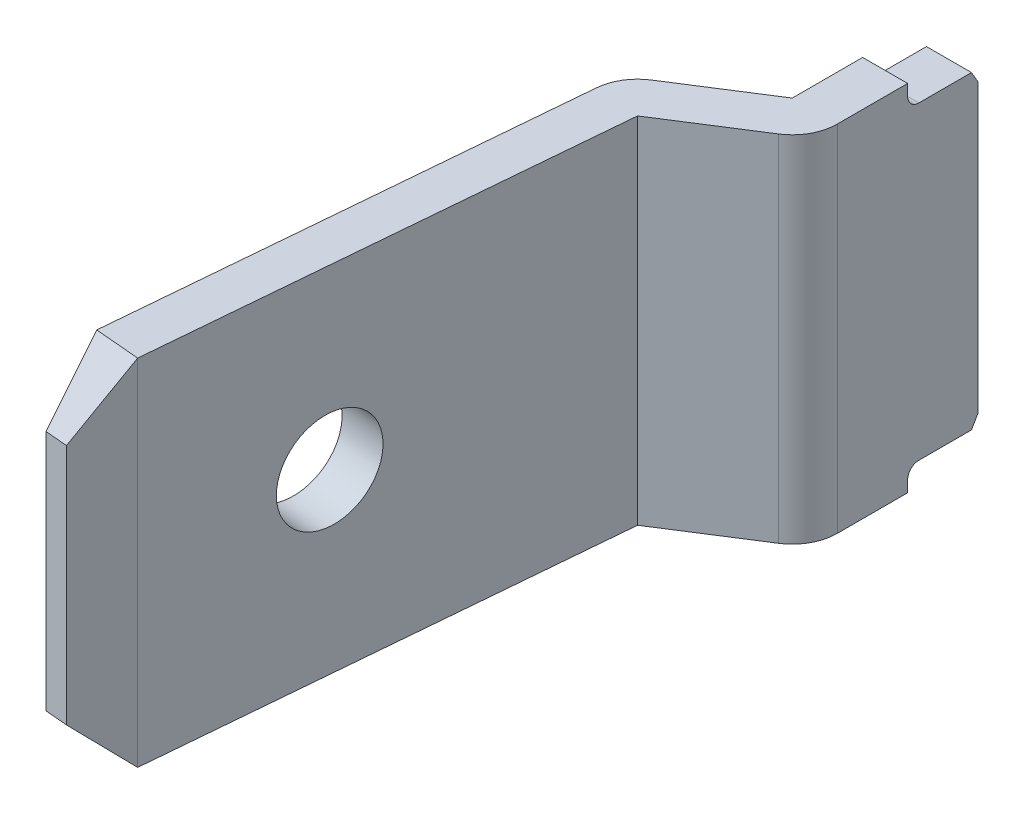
ISO-10303-21;
HEADER;
FILE_DESCRIPTION(('STEP AP214'),'2;1');
FILE_NAME('part.step','',(''),(''),'','','');
FILE_SCHEMA(('AUTOMOTIVE_DESIGN { 1 0 10303 214 1 1 1 1 }'));
ENDSEC;
DATA;
#1=APPLICATION_CONTEXT('core data for automotive mechanical design processes');
#2=APPLICATION_PROTOCOL_DEFINITION('international standard','automotive_design',2000,#1);
#3=PRODUCT_CONTEXT('',#1,'mechanical');
#4=PRODUCT('Part','Part','',(#3));
#5=PRODUCT_RELATED_PRODUCT_CATEGORY('part','',(#4));
#6=PRODUCT_DEFINITION_FORMATION('','',#4);
#7=PRODUCT_DEFINITION_CONTEXT('part definition',#1,'design');
#8=PRODUCT_DEFINITION('design','',#6,#7);
#9=PRODUCT_DEFINITION_SHAPE('','',#8);
#10=(LENGTH_UNIT() NAMED_UNIT(*) SI_UNIT(.MILLI.,.METRE.));
#11=(NAMED_UNIT(*) PLANE_ANGLE_UNIT() SI_UNIT($,.RADIAN.));
#12=(NAMED_UNIT(*) SI_UNIT($,.STERADIAN.) SOLID_ANGLE_UNIT());
#13=UNCERTAINTY_MEASURE_WITH_UNIT(LENGTH_MEASURE(1.E-05),#10,'distance_accuracy_value','');
#14=(GEOMETRIC_REPRESENTATION_CONTEXT(3) GLOBAL_UNCERTAINTY_ASSIGNED_CONTEXT((#13)) GLOBAL_UNIT_ASSIGNED_CONTEXT((#10,
#11,#12)) REPRESENTATION_CONTEXT('',''));
#15=CARTESIAN_POINT('',(0.,0.,0.));
#16=DIRECTION('',(0.,0.,1.));
#17=DIRECTION('',(1.,0.,0.));
#18=AXIS2_PLACEMENT_3D('',#15,#16,#17);
#19=CARTESIAN_POINT('',(-9.8,5.025,2.8));
#20=DIRECTION('',(-1.,0.,0.));
#21=DIRECTION('',(0.,0.,1.));
#22=AXIS2_PLACEMENT_3D('',#19,#20,#21);
#23=PLANE('',#22);
#24=CARTESIAN_POINT('',(-9.8,7.975,3.85));
#25=DIRECTION('',(-1.,0.,0.));
#26=DIRECTION('',(0.,0.,1.));
#27=AXIS2_PLACEMENT_3D('',#24,#25,#26);
#28=CIRCLE('',#27,0.200000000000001);
#29=CARTESIAN_POINT('',(-9.8,7.775,3.85));
#30=VERTEX_POINT('',#29);
#31=CARTESIAN_POINT('',(-9.8,7.975,4.05));
#32=VERTEX_POINT('',#31);
#33=EDGE_CURVE('E230',#30,#32,#28,.T.);
#34=ORIENTED_EDGE('',*,*,#33,.T.);
#35=DIRECTION('',(0.,1.,0.));
#36=VECTOR('',#35,1.);
#37=CARTESIAN_POINT('',(-9.8,5.025,4.05));
#38=LINE('',#37,#36);
#39=CARTESIAN_POINT('',(-9.8,8.175,4.05));
#40=VERTEX_POINT('',#39);
#41=EDGE_CURVE('E175',#40,#32,#38,.F.);
#42=ORIENTED_EDGE('',*,*,#41,.F.);
#43=DIRECTION('',(0.,0.,1.));
#44=VECTOR('',#43,1.);
#45=CARTESIAN_POINT('',(-9.8,8.175,2.8));
#46=LINE('',#45,#44);
#47=CARTESIAN_POINT('',(-9.8,8.175,5.30067147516));
#48=VERTEX_POINT('',#47);
#49=EDGE_CURVE('E148',#48,#40,#46,.F.);
#50=ORIENTED_EDGE('',*,*,#49,.F.);
#51=DIRECTION('',(0.,-1.,0.));
#52=VECTOR('',#51,1.);
#53=CARTESIAN_POINT('',(-9.8,5.025,5.30067147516));
#54=LINE('',#53,#52);
#55=CARTESIAN_POINT('',(-9.8,1.875,5.30067147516));
#56=VERTEX_POINT('',#55);
#57=EDGE_CURVE('E172',#56,#48,#54,.F.);
#58=ORIENTED_EDGE('',*,*,#57,.F.);
#59=DIRECTION('',(0.,0.,1.));
#60=VECTOR('',#59,1.);
#61=CARTESIAN_POINT('',(-9.8,1.875,2.8));
#62=LINE('',#61,#60);
#63=CARTESIAN_POINT('',(-9.8,1.875,4.05));
#64=VERTEX_POINT('',#63);
#65=EDGE_CURVE('E159',#64,#56,#62,.T.);
#66=ORIENTED_EDGE('',*,*,#65,.F.);
#67=DIRECTION('',(0.,1.,0.));
#68=VECTOR('',#67,1.);
#69=CARTESIAN_POINT('',(-9.8,5.025,4.05));
#70=LINE('',#69,#68);
#71=CARTESIAN_POINT('',(-9.8,2.075,4.05));
#72=VERTEX_POINT('',#71);
#73=EDGE_CURVE('E95',#72,#64,#70,.F.);
#74=ORIENTED_EDGE('',*,*,#73,.F.);
#75=CARTESIAN_POINT('',(-9.8,2.075,3.85));
#76=DIRECTION('',(-1.,0.,0.));
#77=DIRECTION('',(0.,0.,1.));
#78=AXIS2_PLACEMENT_3D('',#75,#76,#77);
#79=CIRCLE('',#78,0.2);
#80=CARTESIAN_POINT('',(-9.8,2.275,3.85));
#81=VERTEX_POINT('',#80);
#82=EDGE_CURVE('E21',#72,#81,#79,.T.);
#83=ORIENTED_EDGE('',*,*,#82,.T.);
#84=DIRECTION('',(0.,0.,1.));
#85=VECTOR('',#84,1.);
#86=CARTESIAN_POINT('',(-9.8,2.275,2.91547005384));
#87=LINE('',#86,#85);
#88=CARTESIAN_POINT('',(-9.8,2.275,2.91547005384));
#89=VERTEX_POINT('',#88);
#90=EDGE_CURVE('E188',#81,#89,#87,.F.);
#91=ORIENTED_EDGE('',*,*,#90,.T.);
#92=DIRECTION('',(0.,0.866025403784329,-0.50000000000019));
#93=VECTOR('',#92,1.);
#94=CARTESIAN_POINT('',(-9.8,2.275,2.91547005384));
#95=LINE('',#94,#93);
#96=CARTESIAN_POINT('',(-9.8,2.47500000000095,2.80000000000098));
#97=VERTEX_POINT('',#96);
#98=EDGE_CURVE('E199',#97,#89,#95,.F.);
#99=ORIENTED_EDGE('',*,*,#98,.F.);
#100=DIRECTION('',(0.,1.,0.));
#101=VECTOR('',#100,1.);
#102=CARTESIAN_POINT('',(-9.8,5.025,2.8));
#103=LINE('',#102,#101);
#104=CARTESIAN_POINT('',(-9.8,7.57499999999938,2.80000000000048));
#105=VERTEX_POINT('',#104);
#106=EDGE_CURVE('E196',#97,#105,#103,.T.);
#107=ORIENTED_EDGE('',*,*,#106,.T.);
#108=DIRECTION('',(0.,-0.866025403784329,-0.50000000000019));
#109=VECTOR('',#108,1.);
#110=CARTESIAN_POINT('',(-9.8,7.775,2.91547005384));
#111=LINE('',#110,#109);
#112=CARTESIAN_POINT('',(-9.8,7.775,2.91547005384));
#113=VERTEX_POINT('',#112);
#114=EDGE_CURVE('E194',#105,#113,#111,.F.);
#115=ORIENTED_EDGE('',*,*,#114,.T.);
#116=DIRECTION('',(0.,0.,-1.));
#117=VECTOR('',#116,1.);
#118=CARTESIAN_POINT('',(-9.8,7.775,3.85));
#119=LINE('',#118,#117);
#120=EDGE_CURVE('E182',#113,#30,#119,.F.);
#121=ORIENTED_EDGE('',*,*,#120,.T.);
#122=EDGE_LOOP('',(#34,#42,#50,#58,#66,#74,#83,#91,#99,#107,#115,#121));
#123=FACE_BOUND('',#122,.T.);
#124=ADVANCED_FACE('F18',(#123),#23,.F.);
#125=CARTESIAN_POINT('',(-10.6,7.775,2.91547005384));
#126=DIRECTION('',(0.,-0.50000000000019,0.866025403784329));
#127=DIRECTION('',(0.,-0.866025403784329,-0.50000000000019));
#128=AXIS2_PLACEMENT_3D('',#125,#126,#127);
#129=PLANE('',#128);
#130=DIRECTION('',(1.,0.,0.));
#131=VECTOR('',#130,1.);
#132=CARTESIAN_POINT('',(-10.6,7.57499999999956,2.8));
#133=LINE('',#132,#131);
#134=CARTESIAN_POINT('',(-10.6,7.57499999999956,2.80000000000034));
#135=VERTEX_POINT('',#134);
#136=EDGE_CURVE('E202',#105,#135,#133,.F.);
#137=ORIENTED_EDGE('',*,*,#136,.T.);
#138=DIRECTION('',(0.,-0.866025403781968,-0.500000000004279));
#139=VECTOR('',#138,1.);
#140=CARTESIAN_POINT('',(-10.6,7.775,2.91547005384));
#141=LINE('',#140,#139);
#142=CARTESIAN_POINT('',(-10.6,7.775,2.91547005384));
#143=VERTEX_POINT('',#142);
#144=EDGE_CURVE('E228',#143,#135,#141,.T.);
#145=ORIENTED_EDGE('',*,*,#144,.F.);
#146=DIRECTION('',(1.,0.,0.));
#147=VECTOR('',#146,1.);
#148=CARTESIAN_POINT('',(-10.6,7.775,2.91547005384));
#149=LINE('',#148,#147);
#150=EDGE_CURVE('E185',#143,#113,#149,.T.);
#151=ORIENTED_EDGE('',*,*,#150,.T.);
#152=ORIENTED_EDGE('',*,*,#114,.F.);
#153=EDGE_LOOP('',(#137,#145,#151,#152));
#154=FACE_BOUND('',#153,.T.);
#155=ADVANCED_FACE('F405',(#154),#129,.F.);
#156=CARTESIAN_POINT('',(-10.6,5.025,2.8));
#157=DIRECTION('',(0.,0.,1.));
#158=DIRECTION('',(1.,0.,0.));
#159=AXIS2_PLACEMENT_3D('',#156,#157,#158);
#160=PLANE('',#159);
#161=ORIENTED_EDGE('',*,*,#106,.F.);
#162=DIRECTION('',(1.,0.,0.));
#163=VECTOR('',#162,1.);
#164=CARTESIAN_POINT('',(-10.6,2.47500000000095,2.80000000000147));
#165=LINE('',#164,#163);
#166=CARTESIAN_POINT('',(-10.6,2.47500000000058,2.80000000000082));
#167=VERTEX_POINT('',#166);
#168=EDGE_CURVE('E201',#167,#97,#165,.T.);
#169=ORIENTED_EDGE('',*,*,#168,.F.);
#170=DIRECTION('',(0.,1.,0.));
#171=VECTOR('',#170,1.);
#172=CARTESIAN_POINT('',(-10.6,5.025,2.8000000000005));
#173=LINE('',#172,#171);
#174=EDGE_CURVE('E251',#135,#167,#173,.F.);
#175=ORIENTED_EDGE('',*,*,#174,.F.);
#176=ORIENTED_EDGE('',*,*,#136,.F.);
#177=EDGE_LOOP('',(#161,#169,#175,#176));
#178=FACE_BOUND('',#177,.T.);
#179=ADVANCED_FACE('F411',(#178),#160,.F.);
#180=CARTESIAN_POINT('',(-10.6,2.275,2.91547005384));
#181=DIRECTION('',(0.,-0.50000000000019,-0.866025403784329));
#182=DIRECTION('',(0.,0.866025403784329,-0.50000000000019));
#183=AXIS2_PLACEMENT_3D('',#180,#181,#182);
#184=PLANE('',#183);
#185=DIRECTION('',(0.,-0.866025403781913,0.500000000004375));
#186=VECTOR('',#185,1.);
#187=CARTESIAN_POINT('',(-10.6,2.47500000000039,2.8000000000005));
#188=LINE('',#187,#186);
#189=CARTESIAN_POINT('',(-10.6,2.275,2.91547005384));
#190=VERTEX_POINT('',#189);
#191=EDGE_CURVE('E248',#167,#190,#188,.T.);
#192=ORIENTED_EDGE('',*,*,#191,.F.);
#193=ORIENTED_EDGE('',*,*,#168,.T.);
#194=ORIENTED_EDGE('',*,*,#98,.T.);
#195=DIRECTION('',(1.,0.,0.));
#196=VECTOR('',#195,1.);
#197=CARTESIAN_POINT('',(-10.6,2.275,2.91547005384));
#198=LINE('',#197,#196);
#199=EDGE_CURVE('E191',#89,#190,#198,.F.);
#200=ORIENTED_EDGE('',*,*,#199,.T.);
#201=EDGE_LOOP('',(#192,#193,#194,#200));
#202=FACE_BOUND('',#201,.T.);
#203=ADVANCED_FACE('F414',(#202),#184,.T.);
#204=CARTESIAN_POINT('',(-10.6,2.275,2.91547005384));
#205=DIRECTION('',(0.,1.,0.));
#206=DIRECTION('',(0.,0.,1.));
#207=AXIS2_PLACEMENT_3D('',#204,#205,#206);
#208=PLANE('',#207);
#209=DIRECTION('',(-1.,0.,0.));
#210=VECTOR('',#209,1.);
#211=CARTESIAN_POINT('',(-10.6,2.275,3.85));
#212=LINE('',#211,#210);
#213=CARTESIAN_POINT('',(-10.6,2.275,3.85));
#214=VERTEX_POINT('',#213);
#215=EDGE_CURVE('E184',#81,#214,#212,.T.);
#216=ORIENTED_EDGE('',*,*,#215,.T.);
#217=DIRECTION('',(0.,0.,1.));
#218=VECTOR('',#217,1.);
#219=CARTESIAN_POINT('',(-10.6,2.275,2.8));
#220=LINE('',#219,#218);
#221=EDGE_CURVE('E225',#190,#214,#220,.T.);
#222=ORIENTED_EDGE('',*,*,#221,.F.);
#223=ORIENTED_EDGE('',*,*,#199,.F.);
#224=ORIENTED_EDGE('',*,*,#90,.F.);
#225=EDGE_LOOP('',(#216,#222,#223,#224));
#226=FACE_BOUND('',#225,.T.);
#227=ADVANCED_FACE('F419',(#226),#208,.F.);
#228=CARTESIAN_POINT('',(-10.6,7.775,3.85));
#229=DIRECTION('',(0.,-1.,0.));
#230=DIRECTION('',(0.,0.,-1.));
#231=AXIS2_PLACEMENT_3D('',#228,#229,#230);
#232=PLANE('',#231);
#233=ORIENTED_EDGE('',*,*,#150,.F.);
#234=DIRECTION('',(0.,0.,1.));
#235=VECTOR('',#234,1.);
#236=CARTESIAN_POINT('',(-10.6,7.775,2.8));
#237=LINE('',#236,#235);
#238=CARTESIAN_POINT('',(-10.6,7.775,3.85));
#239=VERTEX_POINT('',#238);
#240=EDGE_CURVE('E221',#239,#143,#237,.F.);
#241=ORIENTED_EDGE('',*,*,#240,.F.);
#242=DIRECTION('',(-1.,0.,0.));
#243=VECTOR('',#242,1.);
#244=CARTESIAN_POINT('',(-10.6,7.775,3.85));
#245=LINE('',#244,#243);
#246=EDGE_CURVE('E231',#239,#30,#245,.F.);
#247=ORIENTED_EDGE('',*,*,#246,.T.);
#248=ORIENTED_EDGE('',*,*,#120,.F.);
#249=EDGE_LOOP('',(#233,#241,#247,#248));
#250=FACE_BOUND('',#249,.T.);
#251=ADVANCED_FACE('F408',(#250),#232,.F.);
#252=CARTESIAN_POINT('',(-10.6,2.075,3.85));
#253=DIRECTION('',(-1.,0.,0.));
#254=DIRECTION('',(0.,0.,1.));
#255=AXIS2_PLACEMENT_3D('',#252,#253,#254);
#256=CYLINDRICAL_SURFACE('',#255,0.2);
#257=DIRECTION('',(-1.,0.,0.));
#258=VECTOR('',#257,1.);
#259=CARTESIAN_POINT('',(-10.6,2.075,4.05));
#260=LINE('',#259,#258);
#261=CARTESIAN_POINT('',(-10.6,2.075,4.05));
#262=VERTEX_POINT('',#261);
#263=EDGE_CURVE('E158',#262,#72,#260,.F.);
#264=ORIENTED_EDGE('',*,*,#263,.F.);
#265=CARTESIAN_POINT('',(-10.6,2.075,3.85));
#266=DIRECTION('',(-1.,0.,0.));
#267=DIRECTION('',(0.,0.,1.));
#268=AXIS2_PLACEMENT_3D('',#265,#266,#267);
#269=CIRCLE('',#268,0.2);
#270=EDGE_CURVE('E223',#214,#262,#269,.F.);
#271=ORIENTED_EDGE('',*,*,#270,.F.);
#272=ORIENTED_EDGE('',*,*,#215,.F.);
#273=ORIENTED_EDGE('',*,*,#82,.F.);
#274=EDGE_LOOP('',(#264,#271,#272,#273));
#275=FACE_BOUND('',#274,.T.);
#276=ADVANCED_FACE('F423',(#275),#256,.F.);
#277=CARTESIAN_POINT('',(-10.6,7.975,3.85));
#278=DIRECTION('',(-1.,0.,0.));
#279=DIRECTION('',(0.,0.,1.));
#280=AXIS2_PLACEMENT_3D('',#277,#278,#279);
#281=CYLINDRICAL_SURFACE('',#280,0.200000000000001);
#282=ORIENTED_EDGE('',*,*,#246,.F.);
#283=CARTESIAN_POINT('',(-10.6,7.975,3.85));
#284=DIRECTION('',(-1.,0.,0.));
#285=DIRECTION('',(0.,0.,1.));
#286=AXIS2_PLACEMENT_3D('',#283,#284,#285);
#287=CIRCLE('',#286,0.200000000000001);
#288=CARTESIAN_POINT('',(-10.6,7.975,4.05));
#289=VERTEX_POINT('',#288);
#290=EDGE_CURVE('E218',#289,#239,#287,.F.);
#291=ORIENTED_EDGE('',*,*,#290,.F.);
#292=DIRECTION('',(-1.,0.,0.));
#293=VECTOR('',#292,1.);
#294=CARTESIAN_POINT('',(-10.6,7.975,4.05));
#295=LINE('',#294,#293);
#296=EDGE_CURVE('E274',#32,#289,#295,.T.);
#297=ORIENTED_EDGE('',*,*,#296,.F.);
#298=ORIENTED_EDGE('',*,*,#33,.F.);
#299=EDGE_LOOP('',(#282,#291,#297,#298));
#300=FACE_BOUND('',#299,.T.);
#301=ADVANCED_FACE('F489',(#300),#281,.F.);
#302=CARTESIAN_POINT('',(-10.6,5.025,5.30067147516));
#303=DIRECTION('',(0.,-1.,0.));
#304=DIRECTION('',(0.,0.,-1.));
#305=AXIS2_PLACEMENT_3D('',#302,#303,#304);
#306=CYLINDRICAL_SURFACE('',#305,0.8);
#307=CARTESIAN_POINT('',(-10.6,8.175,5.30067147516));
#308=DIRECTION('',(0.,-1.,0.));
#309=DIRECTION('',(0.,0.,-1.));
#310=AXIS2_PLACEMENT_3D('',#307,#308,#309);
#311=CIRCLE('',#310,0.8);
#312=CARTESIAN_POINT('',(-10.1701603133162,8.175,5.97538463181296));
#313=VERTEX_POINT('',#312);
#314=EDGE_CURVE('E226',#48,#313,#311,.T.);
#315=ORIENTED_EDGE('',*,*,#314,.T.);
#316=DIRECTION('',(0.,1.,0.));
#317=VECTOR('',#316,1.);
#318=CARTESIAN_POINT('',(-10.1701603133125,5.025,5.97538463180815));
#319=LINE('',#318,#317);
#320=CARTESIAN_POINT('',(-10.170160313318,1.875,5.97538463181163));
#321=VERTEX_POINT('',#320);
#322=EDGE_CURVE('E284',#321,#313,#319,.T.);
#323=ORIENTED_EDGE('',*,*,#322,.F.);
#324=CARTESIAN_POINT('',(-10.6,1.875,5.30067147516));
#325=DIRECTION('',(0.,-1.,0.));
#326=DIRECTION('',(0.,0.,-1.));
#327=AXIS2_PLACEMENT_3D('',#324,#325,#326);
#328=CIRCLE('',#327,0.8);
#329=EDGE_CURVE('E229',#321,#56,#328,.F.);
#330=ORIENTED_EDGE('',*,*,#329,.T.);
#331=ORIENTED_EDGE('',*,*,#57,.T.);
#332=EDGE_LOOP('',(#315,#323,#330,#331));
#333=FACE_BOUND('',#332,.T.);
#334=ADVANCED_FACE('F283',(#333),#306,.T.);
#335=CARTESIAN_POINT('',(-10.6,5.025,2.8));
#336=DIRECTION('',(-1.,0.,0.));
#337=DIRECTION('',(0.,0.,1.));
#338=AXIS2_PLACEMENT_3D('',#335,#336,#337);
#339=PLANE('',#338);
#340=ORIENTED_EDGE('',*,*,#290,.T.);
#341=ORIENTED_EDGE('',*,*,#240,.T.);
#342=ORIENTED_EDGE('',*,*,#144,.T.);
#343=ORIENTED_EDGE('',*,*,#174,.T.);
#344=ORIENTED_EDGE('',*,*,#191,.T.);
#345=ORIENTED_EDGE('',*,*,#221,.T.);
#346=ORIENTED_EDGE('',*,*,#270,.T.);
#347=DIRECTION('',(0.,1.,0.));
#348=VECTOR('',#347,1.);
#349=CARTESIAN_POINT('',(-10.6,7.975,4.05));
#350=LINE('',#349,#348);
#351=CARTESIAN_POINT('',(-10.6,1.875,4.05));
#352=VERTEX_POINT('',#351);
#353=EDGE_CURVE('E366',#352,#262,#350,.T.);
#354=ORIENTED_EDGE('',*,*,#353,.F.);
#355=DIRECTION('',(0.,0.,1.));
#356=VECTOR('',#355,1.);
#357=CARTESIAN_POINT('',(-10.6,1.875,2.8));
#358=LINE('',#357,#356);
#359=CARTESIAN_POINT('',(-10.6000000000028,1.875,5.30067147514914));
#360=VERTEX_POINT('',#359);
#361=EDGE_CURVE('E165',#352,#360,#358,.T.);
#362=ORIENTED_EDGE('',*,*,#361,.T.);
#363=DIRECTION('',(0.,1.,0.));
#364=VECTOR('',#363,1.);
#365=CARTESIAN_POINT('',(-10.6000000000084,5.025,5.30067147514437));
#366=LINE('',#365,#364);
#367=CARTESIAN_POINT('',(-10.6000000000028,8.175,5.30067147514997));
#368=VERTEX_POINT('',#367);
#369=EDGE_CURVE('E318',#360,#368,#366,.T.);
#370=ORIENTED_EDGE('',*,*,#369,.T.);
#371=DIRECTION('',(0.,0.,1.));
#372=VECTOR('',#371,1.);
#373=CARTESIAN_POINT('',(-10.6,8.175,2.8));
#374=LINE('',#373,#372);
#375=CARTESIAN_POINT('',(-10.6,8.175,4.05));
#376=VERTEX_POINT('',#375);
#377=EDGE_CURVE('E222',#368,#376,#374,.F.);
#378=ORIENTED_EDGE('',*,*,#377,.T.);
#379=DIRECTION('',(0.,1.,0.));
#380=VECTOR('',#379,1.);
#381=CARTESIAN_POINT('',(-10.6,7.975,4.05));
#382=LINE('',#381,#380);
#383=EDGE_CURVE('E336',#289,#376,#382,.T.);
#384=ORIENTED_EDGE('',*,*,#383,.F.);
#385=EDGE_LOOP('',(#340,#341,#342,#343,#344,#345,#346,#354,#362,#370,#378,#384));
#386=FACE_BOUND('',#385,.T.);
#387=ADVANCED_FACE('F401',(#386),#339,.T.);
#388=CARTESIAN_POINT('',(-12.4146770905,9.435,15.1187965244));
#389=DIRECTION('',(-0.959756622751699,0.,-0.280833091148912));
#390=DIRECTION('',(-0.280833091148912,0.,0.959756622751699));
#391=AXIS2_PLACEMENT_3D('',#388,#389,#390);
#392=PLANE('',#391);
#393=DIRECTION('',(0.,1.,0.));
#394=VECTOR('',#393,1.);
#395=CARTESIAN_POINT('',(-12.4146770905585,5.025,15.1187965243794));
#396=LINE('',#395,#394);
#397=CARTESIAN_POINT('',(-12.4146770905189,8.17499999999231,15.1187965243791));
#398=VERTEX_POINT('',#397);
#399=CARTESIAN_POINT('',(-12.4146770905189,1.87500000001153,15.1187965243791));
#400=VERTEX_POINT('',#399);
#401=EDGE_CURVE('E327',#398,#400,#396,.F.);
#402=ORIENTED_EDGE('',*,*,#401,.F.);
#403=DIRECTION('',(-0.20051638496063,-0.700140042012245,0.685271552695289));
#404=VECTOR('',#403,1.);
#405=CARTESIAN_POINT('',(-12.4146770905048,8.17499999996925,15.1187965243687));
#406=LINE('',#405,#404);
#407=CARTESIAN_POINT('',(-12.7010717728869,7.17499999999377,16.0975600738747));
#408=VERTEX_POINT('',#407);
#409=EDGE_CURVE('E334',#398,#408,#406,.T.);
#410=ORIENTED_EDGE('',*,*,#409,.T.);
#411=DIRECTION('',(0.,1.,0.));
#412=VECTOR('',#411,1.);
#413=CARTESIAN_POINT('',(-12.7010717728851,5.025,16.0975600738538));
#414=LINE('',#413,#412);
#415=CARTESIAN_POINT('',(-12.7010717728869,2.87500000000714,16.0975600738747));
#416=VERTEX_POINT('',#415);
#417=EDGE_CURVE('E103',#416,#408,#414,.T.);
#418=ORIENTED_EDGE('',*,*,#417,.F.);
#419=DIRECTION('',(-0.20051638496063,0.700140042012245,0.685271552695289));
#420=VECTOR('',#419,1.);
#421=CARTESIAN_POINT('',(-12.4146770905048,1.87500000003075,15.1187965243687));
#422=LINE('',#421,#420);
#423=EDGE_CURVE('E346',#400,#416,#422,.T.);
#424=ORIENTED_EDGE('',*,*,#423,.F.);
#425=EDGE_LOOP('',(#402,#410,#418,#424));
#426=FACE_BOUND('',#425,.T.);
#427=ADVANCED_FACE('F534',(#426),#392,.F.);
#428=CARTESIAN_POINT('',(-10.6,7.975,4.05));
#429=DIRECTION('',(0.,0.,-1.));
#430=DIRECTION('',(-1.,0.,0.));
#431=AXIS2_PLACEMENT_3D('',#428,#429,#430);
#432=PLANE('',#431);
#433=ORIENTED_EDGE('',*,*,#263,.T.);
#434=ORIENTED_EDGE('',*,*,#73,.T.);
#435=DIRECTION('',(1.,0.,0.));
#436=VECTOR('',#435,1.);
#437=CARTESIAN_POINT('',(0.,1.875,4.05));
#438=LINE('',#437,#436);
#439=EDGE_CURVE('E156',#64,#352,#438,.F.);
#440=ORIENTED_EDGE('',*,*,#439,.T.);
#441=ORIENTED_EDGE('',*,*,#353,.T.);
#442=EDGE_LOOP('',(#433,#434,#440,#441));
#443=FACE_BOUND('',#442,.T.);
#444=ADVANCED_FACE('F154',(#443),#432,.T.);
#445=CARTESIAN_POINT('',(-13.2987885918,5.025,16.0452666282));
#446=DIRECTION('',(-0.0871557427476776,0.,0.996194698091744));
#447=DIRECTION('',(0.996194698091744,0.,0.0871557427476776));
#448=AXIS2_PLACEMENT_3D('',#445,#446,#447);
#449=PLANE('',#448);
#450=DIRECTION('',(-0.99619469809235,6.87058916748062E-12,-0.0871557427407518));
#451=VECTOR('',#450,1.);
#452=CARTESIAN_POINT('',(-12.7010717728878,2.87500000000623,16.0975600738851));
#453=LINE('',#452,#451);
#454=CARTESIAN_POINT('',(-13.0995496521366,2.87499999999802,16.0626977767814));
#455=VERTEX_POINT('',#454);
#456=EDGE_CURVE('E343',#416,#455,#453,.T.);
#457=ORIENTED_EDGE('',*,*,#456,.F.);
#458=ORIENTED_EDGE('',*,*,#417,.T.);
#459=DIRECTION('',(-0.996194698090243,1.72973614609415E-11,-0.0871557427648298));
#460=VECTOR('',#459,1.);
#461=CARTESIAN_POINT('',(-12.7010717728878,7.17499999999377,16.0975600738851));
#462=LINE('',#461,#460);
#463=CARTESIAN_POINT('',(-13.0995496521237,7.17499999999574,16.0626977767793));
#464=VERTEX_POINT('',#463);
#465=EDGE_CURVE('E319',#408,#464,#462,.T.);
#466=ORIENTED_EDGE('',*,*,#465,.T.);
#467=DIRECTION('',(0.,1.,0.));
#468=VECTOR('',#467,1.);
#469=CARTESIAN_POINT('',(-13.0995496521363,0.615,16.0626977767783));
#470=LINE('',#469,#468);
#471=EDGE_CURVE('E298',#464,#455,#470,.F.);
#472=ORIENTED_EDGE('',*,*,#471,.T.);
#473=EDGE_LOOP('',(#457,#458,#466,#472));
#474=FACE_BOUND('',#473,.T.);
#475=ADVANCED_FACE('F469',(#474),#449,.T.);
#476=CARTESIAN_POINT('',(-9.1873980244,2.875,16.4049666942));
#477=DIRECTION('',(-0.0616284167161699,-0.707106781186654,0.704416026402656));
#478=DIRECTION('',(0.,-0.705757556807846,-0.708453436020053));
#479=AXIS2_PLACEMENT_3D('',#476,#477,#478);
#480=PLANE('',#479);
#481=DIRECTION('',(0.996194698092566,0.,0.0871557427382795));
#482=VECTOR('',#481,1.);
#483=CARTESIAN_POINT('',(-13.2116328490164,1.875,15.0490719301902));
#484=LINE('',#483,#482);
#485=CARTESIAN_POINT('',(-13.211632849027,1.87500000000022,15.049071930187));
#486=VERTEX_POINT('',#485);
#487=EDGE_CURVE('E300',#486,#400,#484,.T.);
#488=ORIENTED_EDGE('',*,*,#487,.T.);
#489=ORIENTED_EDGE('',*,*,#423,.T.);
#490=ORIENTED_EDGE('',*,*,#456,.T.);
#491=DIRECTION('',(-0.0784739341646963,-0.700140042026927,-0.709680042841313));
#492=VECTOR('',#491,1.);
#493=CARTESIAN_POINT('',(-13.0995496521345,2.87500000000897,16.062697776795));
#494=LINE('',#493,#492);
#495=EDGE_CURVE('E351',#455,#486,#494,.T.);
#496=ORIENTED_EDGE('',*,*,#495,.T.);
#497=EDGE_LOOP('',(#488,#489,#490,#496));
#498=FACE_BOUND('',#497,.T.);
#499=ADVANCED_FACE('F473',(#498),#480,.T.);
#500=CARTESIAN_POINT('',(-10.6,7.975,4.05));
#501=DIRECTION('',(0.,0.,-1.));
#502=DIRECTION('',(-1.,0.,0.));
#503=AXIS2_PLACEMENT_3D('',#500,#501,#502);
#504=PLANE('',#503);
#505=ORIENTED_EDGE('',*,*,#296,.T.);
#506=ORIENTED_EDGE('',*,*,#383,.T.);
#507=DIRECTION('',(1.,0.,0.));
#508=VECTOR('',#507,1.);
#509=CARTESIAN_POINT('',(0.,8.175,4.05));
#510=LINE('',#509,#508);
#511=EDGE_CURVE('E275',#40,#376,#510,.F.);
#512=ORIENTED_EDGE('',*,*,#511,.F.);
#513=ORIENTED_EDGE('',*,*,#41,.T.);
#514=EDGE_LOOP('',(#505,#506,#512,#513));
#515=FACE_BOUND('',#514,.T.);
#516=ADVANCED_FACE('F272',(#515),#504,.T.);
#517=CARTESIAN_POINT('',(-9.1873980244,7.175,16.4049666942));
#518=DIRECTION('',(0.0616284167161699,-0.707106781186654,-0.704416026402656));
#519=DIRECTION('',(0.,0.705757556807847,-0.708453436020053));
#520=AXIS2_PLACEMENT_3D('',#517,#518,#519);
#521=PLANE('',#520);
#522=ORIENTED_EDGE('',*,*,#409,.F.);
#523=DIRECTION('',(0.996194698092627,0.,0.0871557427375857));
#524=VECTOR('',#523,1.);
#525=CARTESIAN_POINT('',(-13.2116328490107,8.175,15.0490719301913));
#526=LINE('',#525,#524);
#527=CARTESIAN_POINT('',(-13.2116328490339,8.17499999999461,15.0490719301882));
#528=VERTEX_POINT('',#527);
#529=EDGE_CURVE('E322',#528,#398,#526,.T.);
#530=ORIENTED_EDGE('',*,*,#529,.F.);
#531=DIRECTION('',(0.0784739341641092,-0.700140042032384,0.709680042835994));
#532=VECTOR('',#531,1.);
#533=CARTESIAN_POINT('',(-13.2116328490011,8.17499999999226,15.0490719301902));
#534=LINE('',#533,#532);
#535=EDGE_CURVE('E295',#528,#464,#534,.T.);
#536=ORIENTED_EDGE('',*,*,#535,.T.);
#537=ORIENTED_EDGE('',*,*,#465,.F.);
#538=EDGE_LOOP('',(#522,#530,#536,#537));
#539=FACE_BOUND('',#538,.T.);
#540=ADVANCED_FACE('F477',(#539),#521,.F.);
#541=CARTESIAN_POINT('',(-11.7,5.025,6.95));
#542=DIRECTION('',(0.537299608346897,0.,0.843391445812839));
#543=DIRECTION('',(0.843391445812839,0.,-0.537299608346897));
#544=AXIS2_PLACEMENT_3D('',#541,#542,#543);
#545=PLANE('',#544);
#546=DIRECTION('',(0.843391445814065,0.,-0.537299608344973));
#547=VECTOR('',#546,1.);
#548=CARTESIAN_POINT('',(-11.7,8.175,6.95));
#549=LINE('',#548,#547);
#550=CARTESIAN_POINT('',(-11.7000000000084,8.175,6.94999999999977));
#551=VERTEX_POINT('',#550);
#552=EDGE_CURVE('E217',#551,#313,#549,.T.);
#553=ORIENTED_EDGE('',*,*,#552,.F.);
#554=DIRECTION('',(0.,1.,0.));
#555=VECTOR('',#554,1.);
#556=CARTESIAN_POINT('',(-11.7000000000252,5.025,6.94999999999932));
#557=LINE('',#556,#555);
#558=CARTESIAN_POINT('',(-11.7000000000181,1.87500000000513,6.94999999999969));
#559=VERTEX_POINT('',#558);
#560=EDGE_CURVE('E168',#559,#551,#557,.T.);
#561=ORIENTED_EDGE('',*,*,#560,.F.);
#562=DIRECTION('',(0.843391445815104,0.,-0.537299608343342));
#563=VECTOR('',#562,1.);
#564=CARTESIAN_POINT('',(-11.7000000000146,1.875,6.95000000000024));
#565=LINE('',#564,#563);
#566=EDGE_CURVE('E288',#559,#321,#565,.T.);
#567=ORIENTED_EDGE('',*,*,#566,.T.);
#568=ORIENTED_EDGE('',*,*,#322,.T.);
#569=EDGE_LOOP('',(#553,#561,#567,#568));
#570=FACE_BOUND('',#569,.T.);
#571=ADVANCED_FACE('F481',(#570),#545,.T.);
#572=CARTESIAN_POINT('',(-12.4625713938,5.025,6.48726031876));
#573=DIRECTION('',(0.537299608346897,0.,0.843391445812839));
#574=DIRECTION('',(0.843391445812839,0.,-0.537299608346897));
#575=AXIS2_PLACEMENT_3D('',#572,#573,#574);
#576=PLANE('',#575);
#577=ORIENTED_EDGE('',*,*,#369,.F.);
#578=DIRECTION('',(-0.843391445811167,0.,0.537299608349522));
#579=VECTOR('',#578,1.);
#580=CARTESIAN_POINT('',(-10.6000000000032,1.875,5.30067147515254));
#581=LINE('',#580,#579);
#582=CARTESIAN_POINT('',(-12.1298396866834,1.875,6.27528684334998));
#583=VERTEX_POINT('',#582);
#584=EDGE_CURVE('E167',#360,#583,#581,.T.);
#585=ORIENTED_EDGE('',*,*,#584,.T.);
#586=DIRECTION('',(0.,-1.,0.));
#587=VECTOR('',#586,1.);
#588=CARTESIAN_POINT('',(-12.129839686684,5.025,6.27528684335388));
#589=LINE('',#588,#587);
#590=CARTESIAN_POINT('',(-12.129839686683,8.175,6.27528684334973));
#591=VERTEX_POINT('',#590);
#592=EDGE_CURVE('E212',#591,#583,#589,.T.);
#593=ORIENTED_EDGE('',*,*,#592,.F.);
#594=DIRECTION('',(-0.843391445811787,0.,0.537299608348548));
#595=VECTOR('',#594,1.);
#596=CARTESIAN_POINT('',(-10.6000000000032,8.175,5.30067147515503));
#597=LINE('',#596,#595);
#598=EDGE_CURVE('E387',#368,#591,#597,.T.);
#599=ORIENTED_EDGE('',*,*,#598,.F.);
#600=EDGE_LOOP('',(#577,#585,#593,#599));
#601=FACE_BOUND('',#600,.T.);
#602=ADVANCED_FACE('F427',(#601),#576,.F.);
#603=CARTESIAN_POINT('',(-12.5018328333,5.025,16.1149912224));
#604=DIRECTION('',(0.996194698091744,0.,0.0871557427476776));
#605=DIRECTION('',(0.0871557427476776,0.,-0.996194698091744));
#606=AXIS2_PLACEMENT_3D('',#603,#604,#605);
#607=PLANE('',#606);
#608=CARTESIAN_POINT('',(-12.1401365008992,5.025,11.9807832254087));
#609=DIRECTION('',(-0.996194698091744,0.,-0.0871557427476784));
#610=DIRECTION('',(-0.0871557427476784,0.,0.996194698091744));
#611=AXIS2_PLACEMENT_3D('',#608,#609,#610);
#612=CIRCLE('',#611,0.874999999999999);
#613=CARTESIAN_POINT('',(-12.2163977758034,5.025,12.8524535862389));
#614=VERTEX_POINT('',#613);
#615=EDGE_CURVE('E208',#614,#614,#612,.T.);
#616=ORIENTED_EDGE('',*,*,#615,.T.);
#617=EDGE_LOOP('',(#616));
#618=FACE_BOUND('',#617,.T.);
#619=DIRECTION('',(0.0871557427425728,0.,-0.99619469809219));
#620=VECTOR('',#619,1.);
#621=CARTESIAN_POINT('',(-12.4146770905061,1.875,15.118796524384));
#622=LINE('',#621,#620);
#623=EDGE_CURVE('E291',#400,#559,#622,.T.);
#624=ORIENTED_EDGE('',*,*,#623,.T.);
#625=ORIENTED_EDGE('',*,*,#560,.T.);
#626=DIRECTION('',(0.087155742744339,0.,-0.996194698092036));
#627=VECTOR('',#626,1.);
#628=CARTESIAN_POINT('',(-12.4146770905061,8.175,15.118796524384));
#629=LINE('',#628,#627);
#630=EDGE_CURVE('E320',#398,#551,#629,.T.);
#631=ORIENTED_EDGE('',*,*,#630,.F.);
#632=ORIENTED_EDGE('',*,*,#401,.T.);
#633=EDGE_LOOP('',(#624,#625,#631,#632));
#634=FACE_BOUND('',#633,.T.);
#635=ADVANCED_FACE('F480',(#618,#634),#607,.T.);
#636=CARTESIAN_POINT('',(0.,1.875,0.));
#637=DIRECTION('',(0.,1.,0.));
#638=DIRECTION('',(0.,0.,1.));
#639=AXIS2_PLACEMENT_3D('',#636,#637,#638);
#640=PLANE('',#639);
#641=ORIENTED_EDGE('',*,*,#329,.F.);
#642=ORIENTED_EDGE('',*,*,#566,.F.);
#643=ORIENTED_EDGE('',*,*,#623,.F.);
#644=ORIENTED_EDGE('',*,*,#487,.F.);
#645=DIRECTION('',(-0.0871557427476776,0.,0.996194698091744));
#646=VECTOR('',#645,1.);
#647=CARTESIAN_POINT('',(-12.4625713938,1.875,6.48726031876));
#648=LINE('',#647,#646);
#649=CARTESIAN_POINT('',(-12.4969557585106,1.875,6.88027540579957));
#650=VERTEX_POINT('',#649);
#651=EDGE_CURVE('E211',#650,#486,#648,.T.);
#652=ORIENTED_EDGE('',*,*,#651,.F.);
#653=CARTESIAN_POINT('',(-11.7,1.875,6.95));
#654=DIRECTION('',(0.,-1.,0.));
#655=DIRECTION('',(0.,0.,-1.));
#656=AXIS2_PLACEMENT_3D('',#653,#654,#655);
#657=CIRCLE('',#656,0.8);
#658=EDGE_CURVE('E214',#583,#650,#657,.F.);
#659=ORIENTED_EDGE('',*,*,#658,.F.);
#660=ORIENTED_EDGE('',*,*,#584,.F.);
#661=ORIENTED_EDGE('',*,*,#361,.F.);
#662=ORIENTED_EDGE('',*,*,#439,.F.);
#663=ORIENTED_EDGE('',*,*,#65,.T.);
#664=EDGE_LOOP('',(#641,#642,#643,#644,#652,#659,#660,#661,#662,#663));
#665=FACE_BOUND('',#664,.T.);
#666=ADVANCED_FACE('F162',(#665),#640,.F.);
#667=CARTESIAN_POINT('',(-13.211632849,0.615,15.0490719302));
#668=DIRECTION('',(0.993941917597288,0.,-0.109906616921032));
#669=DIRECTION('',(-0.109906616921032,0.,-0.993941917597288));
#670=AXIS2_PLACEMENT_3D('',#667,#668,#669);
#671=PLANE('',#670);
#672=ORIENTED_EDGE('',*,*,#471,.F.);
#673=ORIENTED_EDGE('',*,*,#535,.F.);
#674=DIRECTION('',(0.,1.,0.));
#675=VECTOR('',#674,1.);
#676=CARTESIAN_POINT('',(-13.2116328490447,5.025,15.0490719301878));
#677=LINE('',#676,#675);
#678=EDGE_CURVE('E441',#486,#528,#677,.T.);
#679=ORIENTED_EDGE('',*,*,#678,.F.);
#680=ORIENTED_EDGE('',*,*,#495,.F.);
#681=EDGE_LOOP('',(#672,#673,#679,#680));
#682=FACE_BOUND('',#681,.T.);
#683=ADVANCED_FACE('F474',(#682),#671,.F.);
#684=CARTESIAN_POINT('',(0.,8.175,0.));
#685=DIRECTION('',(0.,1.,0.));
#686=DIRECTION('',(0.,0.,1.));
#687=AXIS2_PLACEMENT_3D('',#684,#685,#686);
#688=PLANE('',#687);
#689=ORIENTED_EDGE('',*,*,#552,.T.);
#690=ORIENTED_EDGE('',*,*,#314,.F.);
#691=ORIENTED_EDGE('',*,*,#49,.T.);
#692=ORIENTED_EDGE('',*,*,#511,.T.);
#693=ORIENTED_EDGE('',*,*,#377,.F.);
#694=ORIENTED_EDGE('',*,*,#598,.T.);
#695=CARTESIAN_POINT('',(-11.7,8.175,6.95));
#696=DIRECTION('',(0.,-1.,0.));
#697=DIRECTION('',(0.,0.,-1.));
#698=AXIS2_PLACEMENT_3D('',#695,#696,#697);
#699=CIRCLE('',#698,0.8);
#700=CARTESIAN_POINT('',(-12.4969557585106,8.17499999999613,6.88027540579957));
#701=VERTEX_POINT('',#700);
#702=EDGE_CURVE('E36',#701,#591,#699,.T.);
#703=ORIENTED_EDGE('',*,*,#702,.F.);
#704=DIRECTION('',(-0.0871557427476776,0.,0.996194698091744));
#705=VECTOR('',#704,1.);
#706=CARTESIAN_POINT('',(-12.4625713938,8.17499999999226,6.48726031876));
#707=LINE('',#706,#705);
#708=EDGE_CURVE('E436',#528,#701,#707,.F.);
#709=ORIENTED_EDGE('',*,*,#708,.F.);
#710=ORIENTED_EDGE('',*,*,#529,.T.);
#711=ORIENTED_EDGE('',*,*,#630,.T.);
#712=EDGE_LOOP('',(#689,#690,#691,#692,#693,#694,#703,#709,#710,#711));
#713=FACE_BOUND('',#712,.T.);
#714=ADVANCED_FACE('F277',(#713),#688,.T.);
#715=CARTESIAN_POINT('',(-11.7,5.025,6.95));
#716=DIRECTION('',(0.,-1.,0.));
#717=DIRECTION('',(0.,0.,-1.));
#718=AXIS2_PLACEMENT_3D('',#715,#716,#717);
#719=CYLINDRICAL_SURFACE('',#718,0.8);
#720=ORIENTED_EDGE('',*,*,#702,.T.);
#721=ORIENTED_EDGE('',*,*,#592,.T.);
#722=ORIENTED_EDGE('',*,*,#658,.T.);
#723=DIRECTION('',(0.,1.,0.));
#724=VECTOR('',#723,1.);
#725=CARTESIAN_POINT('',(-12.4969557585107,5.025,6.88027540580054));
#726=LINE('',#725,#724);
#727=EDGE_CURVE('E27',#701,#650,#726,.F.);
#728=ORIENTED_EDGE('',*,*,#727,.F.);
#729=EDGE_LOOP('',(#720,#721,#722,#728));
#730=FACE_BOUND('',#729,.T.);
#731=ADVANCED_FACE('F433',(#730),#719,.T.);
#732=CARTESIAN_POINT('',(-11.0943855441,5.025,12.072274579));
#733=DIRECTION('',(-0.996194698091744,0.,-0.0871557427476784));
#734=DIRECTION('',(-0.0871557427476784,0.,0.996194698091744));
#735=AXIS2_PLACEMENT_3D('',#732,#733,#734);
#736=CYLINDRICAL_SURFACE('',#735,0.874999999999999);
#737=CARTESIAN_POINT('',(-12.9370922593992,5.025,11.9110586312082));
#738=DIRECTION('',(-0.996194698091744,0.,-0.0871557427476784));
#739=DIRECTION('',(-0.0871557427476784,0.,0.996194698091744));
#740=AXIS2_PLACEMENT_3D('',#737,#738,#739);
#741=CIRCLE('',#740,0.874999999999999);
#742=CARTESIAN_POINT('',(-13.0133535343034,5.025,12.7827289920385));
#743=VERTEX_POINT('',#742);
#744=EDGE_CURVE('E11',#743,#743,#741,.F.);
#745=ORIENTED_EDGE('',*,*,#744,.F.);
#746=EDGE_LOOP('',(#745));
#747=FACE_BOUND('',#746,.T.);
#748=ORIENTED_EDGE('',*,*,#615,.F.);
#749=EDGE_LOOP('',(#748));
#750=FACE_BOUND('',#749,.T.);
#751=ADVANCED_FACE('F500',(#747,#750),#736,.F.);
#752=CARTESIAN_POINT('',(-12.4625713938,5.025,6.48726031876));
#753=DIRECTION('',(-0.996194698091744,0.,-0.0871557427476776));
#754=DIRECTION('',(-0.0871557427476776,0.,0.996194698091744));
#755=AXIS2_PLACEMENT_3D('',#752,#753,#754);
#756=PLANE('',#755);
#757=ORIENTED_EDGE('',*,*,#744,.T.);
#758=EDGE_LOOP('',(#757));
#759=FACE_BOUND('',#758,.T.);
#760=ORIENTED_EDGE('',*,*,#708,.T.);
#761=ORIENTED_EDGE('',*,*,#727,.T.);
#762=ORIENTED_EDGE('',*,*,#651,.T.);
#763=ORIENTED_EDGE('',*,*,#678,.T.);
#764=EDGE_LOOP('',(#760,#761,#762,#763));
#765=FACE_BOUND('',#764,.T.);
#766=ADVANCED_FACE('F439',(#759,#765),#756,.T.);
#767=CLOSED_SHELL('',(#124,#155,#179,#203,#227,#251,#276,#301,#334,#387,#427,#444,#475,#499,
#516,#540,#571,#602,#635,#666,#683,#714,#731,#751,#766));
#768=MANIFOLD_SOLID_BREP('B1',#767);
#769=ADVANCED_BREP_SHAPE_REPRESENTATION('',(#18,#768),#14);
#770=SHAPE_DEFINITION_REPRESENTATION(#9,#769);
ENDSEC;
END-ISO-10303-21;
